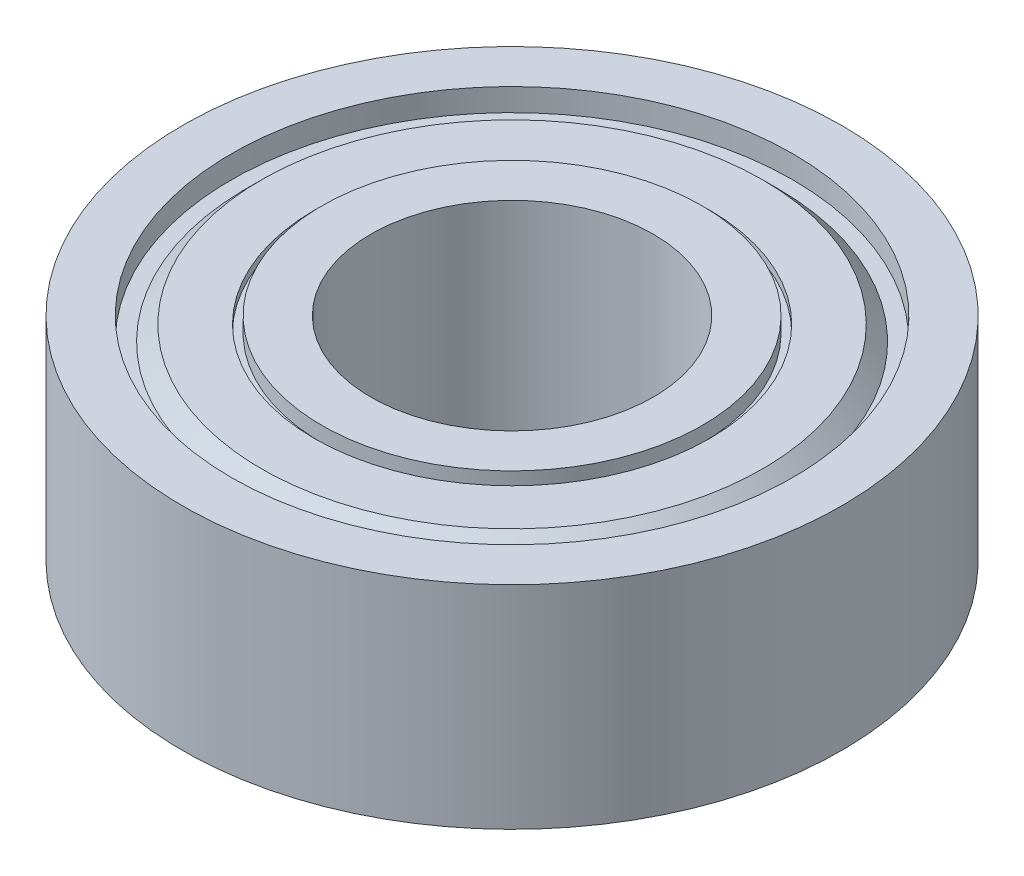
ISO-10303-21;
HEADER;
FILE_DESCRIPTION(('STEP AP214'),'2;1');
FILE_NAME('part.step','',(''),(''),'','','');
FILE_SCHEMA(('AUTOMOTIVE_DESIGN { 1 0 10303 214 1 1 1 1 }'));
ENDSEC;
DATA;
#1=APPLICATION_CONTEXT('core data for automotive mechanical design processes');
#2=APPLICATION_PROTOCOL_DEFINITION('international standard','automotive_design',2000,#1);
#3=PRODUCT_CONTEXT('',#1,'mechanical');
#4=PRODUCT('Part','Part','',(#3));
#5=PRODUCT_RELATED_PRODUCT_CATEGORY('part','',(#4));
#6=PRODUCT_DEFINITION_FORMATION('','',#4);
#7=PRODUCT_DEFINITION_CONTEXT('part definition',#1,'design');
#8=PRODUCT_DEFINITION('design','',#6,#7);
#9=PRODUCT_DEFINITION_SHAPE('','',#8);
#10=(LENGTH_UNIT() NAMED_UNIT(*) SI_UNIT(.MILLI.,.METRE.));
#11=(NAMED_UNIT(*) PLANE_ANGLE_UNIT() SI_UNIT($,.RADIAN.));
#12=(NAMED_UNIT(*) SI_UNIT($,.STERADIAN.) SOLID_ANGLE_UNIT());
#13=UNCERTAINTY_MEASURE_WITH_UNIT(LENGTH_MEASURE(1.E-05),#10,'distance_accuracy_value','');
#14=(GEOMETRIC_REPRESENTATION_CONTEXT(3) GLOBAL_UNCERTAINTY_ASSIGNED_CONTEXT((#13)) GLOBAL_UNIT_ASSIGNED_CONTEXT((#10,
#11,#12)) REPRESENTATION_CONTEXT('',''));
#15=CARTESIAN_POINT('',(0.,0.,0.));
#16=DIRECTION('',(0.,0.,1.));
#17=DIRECTION('',(1.,0.,0.));
#18=AXIS2_PLACEMENT_3D('',#15,#16,#17);
#19=CARTESIAN_POINT('',(4.7625,0.,0.));
#20=DIRECTION('',(0.,-1.,0.));
#21=DIRECTION('',(0.,0.,-1.));
#22=AXIS2_PLACEMENT_3D('',#19,#20,#21);
#23=PLANE('',#22);
#24=CARTESIAN_POINT('',(0.,0.,0.));
#25=DIRECTION('',(0.,-1.,0.));
#26=DIRECTION('',(0.,0.,-1.));
#27=AXIS2_PLACEMENT_3D('',#24,#25,#26);
#28=CIRCLE('',#27,6.4135);
#29=CARTESIAN_POINT('',(0.,0.,-6.4135));
#30=VERTEX_POINT('',#29);
#31=EDGE_CURVE('E10',#30,#30,#28,.T.);
#32=ORIENTED_EDGE('',*,*,#31,.T.);
#33=EDGE_LOOP('',(#32));
#34=FACE_BOUND('',#33,.T.);
#35=CARTESIAN_POINT('',(0.,0.,0.));
#36=DIRECTION('',(0.,-1.,0.));
#37=DIRECTION('',(0.,0.,-1.));
#38=AXIS2_PLACEMENT_3D('',#35,#36,#37);
#39=CIRCLE('',#38,4.7625);
#40=CARTESIAN_POINT('',(0.,0.,-4.7625));
#41=VERTEX_POINT('',#40);
#42=EDGE_CURVE('E92',#41,#41,#39,.T.);
#43=ORIENTED_EDGE('',*,*,#42,.F.);
#44=EDGE_LOOP('',(#43));
#45=FACE_BOUND('',#44,.T.);
#46=ADVANCED_FACE('F28',(#34,#45),#23,.T.);
#47=CARTESIAN_POINT('',(0.,0.,0.));
#48=DIRECTION('',(0.,-1.,0.));
#49=DIRECTION('',(0.,0.,-1.));
#50=AXIS2_PLACEMENT_3D('',#47,#48,#49);
#51=CYLINDRICAL_SURFACE('',#50,6.4135);
#52=CARTESIAN_POINT('',(0.,0.507999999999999,0.));
#53=DIRECTION('',(0.,-1.,0.));
#54=DIRECTION('',(0.,0.,-1.));
#55=AXIS2_PLACEMENT_3D('',#52,#53,#54);
#56=CIRCLE('',#55,6.4135);
#57=CARTESIAN_POINT('',(0.,0.507999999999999,-6.4135));
#58=VERTEX_POINT('',#57);
#59=EDGE_CURVE('E34',#58,#58,#56,.T.);
#60=ORIENTED_EDGE('',*,*,#59,.T.);
#61=EDGE_LOOP('',(#60));
#62=FACE_BOUND('',#61,.T.);
#63=ORIENTED_EDGE('',*,*,#31,.F.);
#64=EDGE_LOOP('',(#63));
#65=FACE_BOUND('',#64,.T.);
#66=ADVANCED_FACE('F100',(#62,#65),#51,.T.);
#67=CARTESIAN_POINT('',(6.4135,0.507999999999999,0.));
#68=DIRECTION('',(0.,-1.,0.));
#69=DIRECTION('',(0.,0.,-1.));
#70=AXIS2_PLACEMENT_3D('',#67,#68,#69);
#71=PLANE('',#70);
#72=CARTESIAN_POINT('',(0.,0.508,0.));
#73=DIRECTION('',(0.,-1.,0.));
#74=DIRECTION('',(0.,0.,-1.));
#75=AXIS2_PLACEMENT_3D('',#72,#73,#74);
#76=CIRCLE('',#75,6.6675);
#77=CARTESIAN_POINT('',(0.,0.508,-6.6675));
#78=VERTEX_POINT('',#77);
#79=EDGE_CURVE('E38',#78,#78,#76,.T.);
#80=ORIENTED_EDGE('',*,*,#79,.T.);
#81=EDGE_LOOP('',(#80));
#82=FACE_BOUND('',#81,.T.);
#83=ORIENTED_EDGE('',*,*,#59,.F.);
#84=EDGE_LOOP('',(#83));
#85=FACE_BOUND('',#84,.T.);
#86=ADVANCED_FACE('F104',(#82,#85),#71,.T.);
#87=CARTESIAN_POINT('',(0.,0.,0.));
#88=DIRECTION('',(0.,-1.,0.));
#89=DIRECTION('',(0.,0.,-1.));
#90=AXIS2_PLACEMENT_3D('',#87,#88,#89);
#91=CYLINDRICAL_SURFACE('',#90,6.6675);
#92=CARTESIAN_POINT('',(0.,0.253999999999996,0.));
#93=DIRECTION('',(0.,-1.,0.));
#94=DIRECTION('',(0.,0.,-1.));
#95=AXIS2_PLACEMENT_3D('',#92,#93,#94);
#96=CIRCLE('',#95,6.6675);
#97=CARTESIAN_POINT('',(0.,0.253999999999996,-6.6675));
#98=VERTEX_POINT('',#97);
#99=EDGE_CURVE('E42',#98,#98,#96,.T.);
#100=ORIENTED_EDGE('',*,*,#99,.T.);
#101=EDGE_LOOP('',(#100));
#102=FACE_BOUND('',#101,.T.);
#103=ORIENTED_EDGE('',*,*,#79,.F.);
#104=EDGE_LOOP('',(#103));
#105=FACE_BOUND('',#104,.T.);
#106=ADVANCED_FACE('F108',(#102,#105),#91,.F.);
#107=CARTESIAN_POINT('',(8.44550000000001,0.253999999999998,0.));
#108=DIRECTION('',(0.,-1.,0.));
#109=DIRECTION('',(0.,0.,-1.));
#110=AXIS2_PLACEMENT_3D('',#107,#108,#109);
#111=PLANE('',#110);
#112=CARTESIAN_POINT('',(0.,0.253999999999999,0.));
#113=DIRECTION('',(0.,-1.,0.));
#114=DIRECTION('',(0.,0.,-1.));
#115=AXIS2_PLACEMENT_3D('',#112,#113,#114);
#116=CIRCLE('',#115,8.44550000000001);
#117=CARTESIAN_POINT('',(0.,0.253999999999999,-8.44550000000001));
#118=VERTEX_POINT('',#117);
#119=EDGE_CURVE('E47',#118,#118,#116,.T.);
#120=ORIENTED_EDGE('',*,*,#119,.T.);
#121=EDGE_LOOP('',(#120));
#122=FACE_BOUND('',#121,.T.);
#123=ORIENTED_EDGE('',*,*,#99,.F.);
#124=EDGE_LOOP('',(#123));
#125=FACE_BOUND('',#124,.T.);
#126=ADVANCED_FACE('F115',(#122,#125),#111,.T.);
#127=CARTESIAN_POINT('',(0.,0.253999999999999,0.));
#128=DIRECTION('',(0.,1.,0.));
#129=DIRECTION('',(0.,0.,1.));
#130=AXIS2_PLACEMENT_3D('',#127,#128,#129);
#131=CONICAL_SURFACE('',#130,8.44550000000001,0.785398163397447);
#132=CARTESIAN_POINT('',(0.,0.761999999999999,0.));
#133=DIRECTION('',(0.,-1.,0.));
#134=DIRECTION('',(0.,0.,-1.));
#135=AXIS2_PLACEMENT_3D('',#132,#133,#134);
#136=CIRCLE('',#135,8.95350000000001);
#137=CARTESIAN_POINT('',(0.,0.761999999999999,-8.95350000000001));
#138=VERTEX_POINT('',#137);
#139=EDGE_CURVE('E50',#138,#138,#136,.T.);
#140=ORIENTED_EDGE('',*,*,#139,.T.);
#141=EDGE_LOOP('',(#140));
#142=FACE_BOUND('',#141,.T.);
#143=ORIENTED_EDGE('',*,*,#119,.F.);
#144=EDGE_LOOP('',(#143));
#145=FACE_BOUND('',#144,.T.);
#146=ADVANCED_FACE('F119',(#142,#145),#131,.T.);
#147=CARTESIAN_POINT('',(9.4615,0.761999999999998,0.));
#148=DIRECTION('',(0.,-1.,0.));
#149=DIRECTION('',(0.,0.,-1.));
#150=AXIS2_PLACEMENT_3D('',#147,#148,#149);
#151=PLANE('',#150);
#152=CARTESIAN_POINT('',(0.,0.761999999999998,0.));
#153=DIRECTION('',(0.,-1.,0.));
#154=DIRECTION('',(0.,0.,-1.));
#155=AXIS2_PLACEMENT_3D('',#152,#153,#154);
#156=CIRCLE('',#155,9.4615);
#157=CARTESIAN_POINT('',(0.,0.761999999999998,-9.4615));
#158=VERTEX_POINT('',#157);
#159=EDGE_CURVE('E53',#158,#158,#156,.T.);
#160=ORIENTED_EDGE('',*,*,#159,.T.);
#161=EDGE_LOOP('',(#160));
#162=FACE_BOUND('',#161,.T.);
#163=ORIENTED_EDGE('',*,*,#139,.F.);
#164=EDGE_LOOP('',(#163));
#165=FACE_BOUND('',#164,.T.);
#166=ADVANCED_FACE('F123',(#162,#165),#151,.T.);
#167=CARTESIAN_POINT('',(0.,0.,0.));
#168=DIRECTION('',(0.,-1.,0.));
#169=DIRECTION('',(0.,0.,-1.));
#170=AXIS2_PLACEMENT_3D('',#167,#168,#169);
#171=CYLINDRICAL_SURFACE('',#170,9.4615);
#172=CARTESIAN_POINT('',(0.,0.,0.));
#173=DIRECTION('',(0.,-1.,0.));
#174=DIRECTION('',(0.,0.,-1.));
#175=AXIS2_PLACEMENT_3D('',#172,#173,#174);
#176=CIRCLE('',#175,9.4615);
#177=CARTESIAN_POINT('',(0.,0.,-9.4615));
#178=VERTEX_POINT('',#177);
#179=EDGE_CURVE('E56',#178,#178,#176,.T.);
#180=ORIENTED_EDGE('',*,*,#179,.T.);
#181=EDGE_LOOP('',(#180));
#182=FACE_BOUND('',#181,.T.);
#183=ORIENTED_EDGE('',*,*,#159,.F.);
#184=EDGE_LOOP('',(#183));
#185=FACE_BOUND('',#184,.T.);
#186=ADVANCED_FACE('F127',(#182,#185),#171,.F.);
#187=CARTESIAN_POINT('',(11.1125,0.,0.));
#188=DIRECTION('',(0.,-1.,0.));
#189=DIRECTION('',(0.,0.,-1.));
#190=AXIS2_PLACEMENT_3D('',#187,#188,#189);
#191=PLANE('',#190);
#192=CARTESIAN_POINT('',(0.,0.,0.));
#193=DIRECTION('',(0.,-1.,0.));
#194=DIRECTION('',(0.,0.,-1.));
#195=AXIS2_PLACEMENT_3D('',#192,#193,#194);
#196=CIRCLE('',#195,11.1125);
#197=CARTESIAN_POINT('',(0.,0.,-11.1125));
#198=VERTEX_POINT('',#197);
#199=EDGE_CURVE('E59',#198,#198,#196,.T.);
#200=ORIENTED_EDGE('',*,*,#199,.T.);
#201=EDGE_LOOP('',(#200));
#202=FACE_BOUND('',#201,.T.);
#203=ORIENTED_EDGE('',*,*,#179,.F.);
#204=EDGE_LOOP('',(#203));
#205=FACE_BOUND('',#204,.T.);
#206=ADVANCED_FACE('F131',(#202,#205),#191,.T.);
#207=CARTESIAN_POINT('',(0.,0.,0.));
#208=DIRECTION('',(0.,-1.,0.));
#209=DIRECTION('',(0.,0.,-1.));
#210=AXIS2_PLACEMENT_3D('',#207,#208,#209);
#211=CYLINDRICAL_SURFACE('',#210,11.1125);
#212=CARTESIAN_POINT('',(0.,7.14375,0.));
#213=DIRECTION('',(0.,-1.,0.));
#214=DIRECTION('',(0.,0.,-1.));
#215=AXIS2_PLACEMENT_3D('',#212,#213,#214);
#216=CIRCLE('',#215,11.1125);
#217=CARTESIAN_POINT('',(0.,7.14375,-11.1125));
#218=VERTEX_POINT('',#217);
#219=EDGE_CURVE('E62',#218,#218,#216,.T.);
#220=ORIENTED_EDGE('',*,*,#219,.T.);
#221=EDGE_LOOP('',(#220));
#222=FACE_BOUND('',#221,.T.);
#223=ORIENTED_EDGE('',*,*,#199,.F.);
#224=EDGE_LOOP('',(#223));
#225=FACE_BOUND('',#224,.T.);
#226=ADVANCED_FACE('F135',(#222,#225),#211,.T.);
#227=CARTESIAN_POINT('',(11.1125,7.14375,0.));
#228=DIRECTION('',(0.,1.,0.));
#229=DIRECTION('',(0.,0.,1.));
#230=AXIS2_PLACEMENT_3D('',#227,#228,#229);
#231=PLANE('',#230);
#232=CARTESIAN_POINT('',(0.,7.14375,0.));
#233=DIRECTION('',(0.,-1.,0.));
#234=DIRECTION('',(0.,0.,-1.));
#235=AXIS2_PLACEMENT_3D('',#232,#233,#234);
#236=CIRCLE('',#235,9.4615);
#237=CARTESIAN_POINT('',(0.,7.14375,-9.4615));
#238=VERTEX_POINT('',#237);
#239=EDGE_CURVE('E65',#238,#238,#236,.T.);
#240=ORIENTED_EDGE('',*,*,#239,.T.);
#241=EDGE_LOOP('',(#240));
#242=FACE_BOUND('',#241,.T.);
#243=ORIENTED_EDGE('',*,*,#219,.F.);
#244=EDGE_LOOP('',(#243));
#245=FACE_BOUND('',#244,.T.);
#246=ADVANCED_FACE('F139',(#242,#245),#231,.T.);
#247=CARTESIAN_POINT('',(0.,0.,0.));
#248=DIRECTION('',(0.,-1.,0.));
#249=DIRECTION('',(0.,0.,-1.));
#250=AXIS2_PLACEMENT_3D('',#247,#248,#249);
#251=CYLINDRICAL_SURFACE('',#250,9.4615);
#252=CARTESIAN_POINT('',(0.,6.38175,0.));
#253=DIRECTION('',(0.,-1.,0.));
#254=DIRECTION('',(0.,0.,-1.));
#255=AXIS2_PLACEMENT_3D('',#252,#253,#254);
#256=CIRCLE('',#255,9.4615);
#257=CARTESIAN_POINT('',(0.,6.38175,-9.4615));
#258=VERTEX_POINT('',#257);
#259=EDGE_CURVE('E68',#258,#258,#256,.T.);
#260=ORIENTED_EDGE('',*,*,#259,.T.);
#261=EDGE_LOOP('',(#260));
#262=FACE_BOUND('',#261,.T.);
#263=ORIENTED_EDGE('',*,*,#239,.F.);
#264=EDGE_LOOP('',(#263));
#265=FACE_BOUND('',#264,.T.);
#266=ADVANCED_FACE('F143',(#262,#265),#251,.F.);
#267=CARTESIAN_POINT('',(9.4615,6.38175,0.));
#268=DIRECTION('',(0.,1.,0.));
#269=DIRECTION('',(0.,0.,1.));
#270=AXIS2_PLACEMENT_3D('',#267,#268,#269);
#271=PLANE('',#270);
#272=CARTESIAN_POINT('',(0.,6.38175,0.));
#273=DIRECTION('',(0.,-1.,0.));
#274=DIRECTION('',(0.,0.,-1.));
#275=AXIS2_PLACEMENT_3D('',#272,#273,#274);
#276=CIRCLE('',#275,8.95350000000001);
#277=CARTESIAN_POINT('',(0.,6.38175,-8.95350000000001));
#278=VERTEX_POINT('',#277);
#279=EDGE_CURVE('E71',#278,#278,#276,.T.);
#280=ORIENTED_EDGE('',*,*,#279,.T.);
#281=EDGE_LOOP('',(#280));
#282=FACE_BOUND('',#281,.T.);
#283=ORIENTED_EDGE('',*,*,#259,.F.);
#284=EDGE_LOOP('',(#283));
#285=FACE_BOUND('',#284,.T.);
#286=ADVANCED_FACE('F147',(#282,#285),#271,.T.);
#287=CARTESIAN_POINT('',(0.,6.38175,0.));
#288=DIRECTION('',(0.,-1.,0.));
#289=DIRECTION('',(0.,0.,-1.));
#290=AXIS2_PLACEMENT_3D('',#287,#288,#289);
#291=CONICAL_SURFACE('',#290,8.95350000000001,0.785398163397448);
#292=CARTESIAN_POINT('',(0.,6.88975,0.));
#293=DIRECTION('',(0.,-1.,0.));
#294=DIRECTION('',(0.,0.,-1.));
#295=AXIS2_PLACEMENT_3D('',#292,#293,#294);
#296=CIRCLE('',#295,8.4455);
#297=CARTESIAN_POINT('',(0.,6.88975,-8.4455));
#298=VERTEX_POINT('',#297);
#299=EDGE_CURVE('E74',#298,#298,#296,.T.);
#300=ORIENTED_EDGE('',*,*,#299,.T.);
#301=EDGE_LOOP('',(#300));
#302=FACE_BOUND('',#301,.T.);
#303=ORIENTED_EDGE('',*,*,#279,.F.);
#304=EDGE_LOOP('',(#303));
#305=FACE_BOUND('',#304,.T.);
#306=ADVANCED_FACE('F151',(#302,#305),#291,.T.);
#307=CARTESIAN_POINT('',(8.4455,6.88975,0.));
#308=DIRECTION('',(0.,1.,0.));
#309=DIRECTION('',(0.,0.,1.));
#310=AXIS2_PLACEMENT_3D('',#307,#308,#309);
#311=PLANE('',#310);
#312=CARTESIAN_POINT('',(0.,6.88975,0.));
#313=DIRECTION('',(0.,-1.,0.));
#314=DIRECTION('',(0.,0.,-1.));
#315=AXIS2_PLACEMENT_3D('',#312,#313,#314);
#316=CIRCLE('',#315,6.6675);
#317=CARTESIAN_POINT('',(0.,6.88975,-6.6675));
#318=VERTEX_POINT('',#317);
#319=EDGE_CURVE('E77',#318,#318,#316,.T.);
#320=ORIENTED_EDGE('',*,*,#319,.T.);
#321=EDGE_LOOP('',(#320));
#322=FACE_BOUND('',#321,.T.);
#323=ORIENTED_EDGE('',*,*,#299,.F.);
#324=EDGE_LOOP('',(#323));
#325=FACE_BOUND('',#324,.T.);
#326=ADVANCED_FACE('F155',(#322,#325),#311,.T.);
#327=CARTESIAN_POINT('',(0.,0.,0.));
#328=DIRECTION('',(0.,-1.,0.));
#329=DIRECTION('',(0.,0.,-1.));
#330=AXIS2_PLACEMENT_3D('',#327,#328,#329);
#331=CYLINDRICAL_SURFACE('',#330,6.6675);
#332=CARTESIAN_POINT('',(0.,6.63575,0.));
#333=DIRECTION('',(0.,-1.,0.));
#334=DIRECTION('',(0.,0.,-1.));
#335=AXIS2_PLACEMENT_3D('',#332,#333,#334);
#336=CIRCLE('',#335,6.6675);
#337=CARTESIAN_POINT('',(0.,6.63575,-6.6675));
#338=VERTEX_POINT('',#337);
#339=EDGE_CURVE('E80',#338,#338,#336,.T.);
#340=ORIENTED_EDGE('',*,*,#339,.T.);
#341=EDGE_LOOP('',(#340));
#342=FACE_BOUND('',#341,.T.);
#343=ORIENTED_EDGE('',*,*,#319,.F.);
#344=EDGE_LOOP('',(#343));
#345=FACE_BOUND('',#344,.T.);
#346=ADVANCED_FACE('F159',(#342,#345),#331,.F.);
#347=CARTESIAN_POINT('',(6.4135,6.63575,0.));
#348=DIRECTION('',(0.,1.,0.));
#349=DIRECTION('',(0.,0.,1.));
#350=AXIS2_PLACEMENT_3D('',#347,#348,#349);
#351=PLANE('',#350);
#352=CARTESIAN_POINT('',(0.,6.63575,0.));
#353=DIRECTION('',(0.,-1.,0.));
#354=DIRECTION('',(0.,0.,-1.));
#355=AXIS2_PLACEMENT_3D('',#352,#353,#354);
#356=CIRCLE('',#355,6.4135);
#357=CARTESIAN_POINT('',(0.,6.63575,-6.4135));
#358=VERTEX_POINT('',#357);
#359=EDGE_CURVE('E83',#358,#358,#356,.T.);
#360=ORIENTED_EDGE('',*,*,#359,.T.);
#361=EDGE_LOOP('',(#360));
#362=FACE_BOUND('',#361,.T.);
#363=ORIENTED_EDGE('',*,*,#339,.F.);
#364=EDGE_LOOP('',(#363));
#365=FACE_BOUND('',#364,.T.);
#366=ADVANCED_FACE('F163',(#362,#365),#351,.T.);
#367=CARTESIAN_POINT('',(0.,0.,0.));
#368=DIRECTION('',(0.,-1.,0.));
#369=DIRECTION('',(0.,0.,-1.));
#370=AXIS2_PLACEMENT_3D('',#367,#368,#369);
#371=CYLINDRICAL_SURFACE('',#370,6.4135);
#372=CARTESIAN_POINT('',(0.,7.14375,0.));
#373=DIRECTION('',(0.,-1.,0.));
#374=DIRECTION('',(0.,0.,-1.));
#375=AXIS2_PLACEMENT_3D('',#372,#373,#374);
#376=CIRCLE('',#375,6.4135);
#377=CARTESIAN_POINT('',(0.,7.14375,-6.4135));
#378=VERTEX_POINT('',#377);
#379=EDGE_CURVE('E86',#378,#378,#376,.T.);
#380=ORIENTED_EDGE('',*,*,#379,.T.);
#381=EDGE_LOOP('',(#380));
#382=FACE_BOUND('',#381,.T.);
#383=ORIENTED_EDGE('',*,*,#359,.F.);
#384=EDGE_LOOP('',(#383));
#385=FACE_BOUND('',#384,.T.);
#386=ADVANCED_FACE('F167',(#382,#385),#371,.T.);
#387=CARTESIAN_POINT('',(4.7625,7.14375,0.));
#388=DIRECTION('',(0.,1.,0.));
#389=DIRECTION('',(0.,0.,1.));
#390=AXIS2_PLACEMENT_3D('',#387,#388,#389);
#391=PLANE('',#390);
#392=CARTESIAN_POINT('',(0.,7.14375,0.));
#393=DIRECTION('',(0.,-1.,0.));
#394=DIRECTION('',(0.,0.,-1.));
#395=AXIS2_PLACEMENT_3D('',#392,#393,#394);
#396=CIRCLE('',#395,4.7625);
#397=CARTESIAN_POINT('',(0.,7.14375,-4.7625));
#398=VERTEX_POINT('',#397);
#399=EDGE_CURVE('E89',#398,#398,#396,.T.);
#400=ORIENTED_EDGE('',*,*,#399,.T.);
#401=EDGE_LOOP('',(#400));
#402=FACE_BOUND('',#401,.T.);
#403=ORIENTED_EDGE('',*,*,#379,.F.);
#404=EDGE_LOOP('',(#403));
#405=FACE_BOUND('',#404,.T.);
#406=ADVANCED_FACE('F171',(#402,#405),#391,.T.);
#407=CARTESIAN_POINT('',(0.,0.,0.));
#408=DIRECTION('',(0.,-1.,0.));
#409=DIRECTION('',(0.,0.,-1.));
#410=AXIS2_PLACEMENT_3D('',#407,#408,#409);
#411=CYLINDRICAL_SURFACE('',#410,4.7625);
#412=ORIENTED_EDGE('',*,*,#42,.T.);
#413=EDGE_LOOP('',(#412));
#414=FACE_BOUND('',#413,.T.);
#415=ORIENTED_EDGE('',*,*,#399,.F.);
#416=EDGE_LOOP('',(#415));
#417=FACE_BOUND('',#416,.T.);
#418=ADVANCED_FACE('F96',(#414,#417),#411,.F.);
#419=CLOSED_SHELL('',(#46,#66,#86,#106,#126,#146,#166,#186,#206,#226,#246,#266,#286,#306,#326,
#346,#366,#386,#406,#418));
#420=MANIFOLD_SOLID_BREP('B2',#419);
#421=ADVANCED_BREP_SHAPE_REPRESENTATION('',(#18,#420),#14);
#422=SHAPE_DEFINITION_REPRESENTATION(#9,#421);
ENDSEC;
END-ISO-10303-21;
